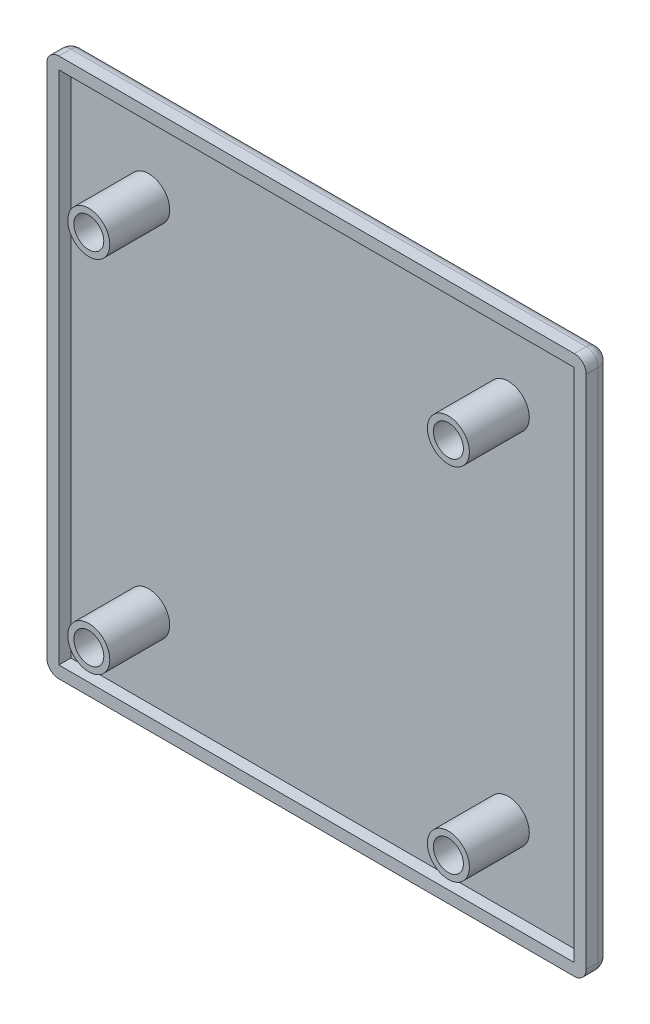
ISO-10303-21;
HEADER;
FILE_DESCRIPTION(('STEP AP214'),'2;1');
FILE_NAME('part.step','',(''),(''),'','','');
FILE_SCHEMA(('AUTOMOTIVE_DESIGN { 1 0 10303 214 1 1 1 1 }'));
ENDSEC;
DATA;
#1=APPLICATION_CONTEXT('core data for automotive mechanical design processes');
#2=APPLICATION_PROTOCOL_DEFINITION('international standard','automotive_design',2000,#1);
#3=PRODUCT_CONTEXT('',#1,'mechanical');
#4=PRODUCT('Part','Part','',(#3));
#5=PRODUCT_RELATED_PRODUCT_CATEGORY('part','',(#4));
#6=PRODUCT_DEFINITION_FORMATION('','',#4);
#7=PRODUCT_DEFINITION_CONTEXT('part definition',#1,'design');
#8=PRODUCT_DEFINITION('design','',#6,#7);
#9=PRODUCT_DEFINITION_SHAPE('','',#8);
#10=(LENGTH_UNIT() NAMED_UNIT(*) SI_UNIT(.MILLI.,.METRE.));
#11=(NAMED_UNIT(*) PLANE_ANGLE_UNIT() SI_UNIT($,.RADIAN.));
#12=(NAMED_UNIT(*) SI_UNIT($,.STERADIAN.) SOLID_ANGLE_UNIT());
#13=UNCERTAINTY_MEASURE_WITH_UNIT(LENGTH_MEASURE(1.E-05),#10,'distance_accuracy_value','');
#14=(GEOMETRIC_REPRESENTATION_CONTEXT(3) GLOBAL_UNCERTAINTY_ASSIGNED_CONTEXT((#13)) GLOBAL_UNIT_ASSIGNED_CONTEXT((#10,
#11,#12)) REPRESENTATION_CONTEXT('',''));
#15=CARTESIAN_POINT('',(0.,0.,0.));
#16=DIRECTION('',(0.,0.,1.));
#17=DIRECTION('',(1.,0.,0.));
#18=AXIS2_PLACEMENT_3D('',#15,#16,#17);
#19=CARTESIAN_POINT('',(0.,0.,0.));
#20=DIRECTION('',(0.,0.,1.));
#21=DIRECTION('',(1.,0.,0.));
#22=AXIS2_PLACEMENT_3D('',#19,#20,#21);
#23=PLANE('',#22);
#24=DIRECTION('',(0.,-1.,0.));
#25=VECTOR('',#24,1.);
#26=CARTESIAN_POINT('',(-43.,45.,0.));
#27=LINE('',#26,#25);
#28=CARTESIAN_POINT('',(-43.,43.,0.));
#29=VERTEX_POINT('',#28);
#30=CARTESIAN_POINT('',(-43.,-43.,0.));
#31=VERTEX_POINT('',#30);
#32=EDGE_CURVE('E140',#29,#31,#27,.T.);
#33=ORIENTED_EDGE('',*,*,#32,.T.);
#34=DIRECTION('',(1.,0.,0.));
#35=VECTOR('',#34,1.);
#36=CARTESIAN_POINT('',(-45.,-43.,0.));
#37=LINE('',#36,#35);
#38=CARTESIAN_POINT('',(43.,-43.,0.));
#39=VERTEX_POINT('',#38);
#40=EDGE_CURVE('E133',#31,#39,#37,.T.);
#41=ORIENTED_EDGE('',*,*,#40,.T.);
#42=DIRECTION('',(0.,1.,0.));
#43=VECTOR('',#42,1.);
#44=CARTESIAN_POINT('',(43.,45.,0.));
#45=LINE('',#44,#43);
#46=CARTESIAN_POINT('',(43.,43.,0.));
#47=VERTEX_POINT('',#46);
#48=EDGE_CURVE('E137',#39,#47,#45,.T.);
#49=ORIENTED_EDGE('',*,*,#48,.T.);
#50=DIRECTION('',(-1.,0.,0.));
#51=VECTOR('',#50,1.);
#52=CARTESIAN_POINT('',(-45.,43.,0.));
#53=LINE('',#52,#51);
#54=EDGE_CURVE('E158',#47,#29,#53,.T.);
#55=ORIENTED_EDGE('',*,*,#54,.T.);
#56=EDGE_LOOP('',(#33,#41,#49,#55));
#57=FACE_BOUND('',#56,.T.);
#58=CARTESIAN_POINT('',(-30.,30.,0.));
#59=DIRECTION('',(0.,0.,1.));
#60=DIRECTION('',(1.,0.,0.));
#61=AXIS2_PLACEMENT_3D('',#58,#59,#60);
#62=CIRCLE('',#61,3.5);
#63=CARTESIAN_POINT('',(-26.5,30.,0.));
#64=VERTEX_POINT('',#63);
#65=EDGE_CURVE('E355',#64,#64,#62,.T.);
#66=ORIENTED_EDGE('',*,*,#65,.F.);
#67=EDGE_LOOP('',(#66));
#68=FACE_BOUND('',#67,.T.);
#69=CARTESIAN_POINT('',(30.,30.,0.));
#70=DIRECTION('',(0.,0.,1.));
#71=DIRECTION('',(1.,0.,0.));
#72=AXIS2_PLACEMENT_3D('',#69,#70,#71);
#73=CIRCLE('',#72,3.5);
#74=CARTESIAN_POINT('',(33.5,30.,0.));
#75=VERTEX_POINT('',#74);
#76=EDGE_CURVE('E363',#75,#75,#73,.T.);
#77=ORIENTED_EDGE('',*,*,#76,.F.);
#78=EDGE_LOOP('',(#77));
#79=FACE_BOUND('',#78,.T.);
#80=CARTESIAN_POINT('',(30.,-30.,0.));
#81=DIRECTION('',(0.,0.,1.));
#82=DIRECTION('',(1.,0.,0.));
#83=AXIS2_PLACEMENT_3D('',#80,#81,#82);
#84=CIRCLE('',#83,3.5);
#85=CARTESIAN_POINT('',(33.5,-30.,0.));
#86=VERTEX_POINT('',#85);
#87=EDGE_CURVE('E372',#86,#86,#84,.T.);
#88=ORIENTED_EDGE('',*,*,#87,.F.);
#89=EDGE_LOOP('',(#88));
#90=FACE_BOUND('',#89,.T.);
#91=CARTESIAN_POINT('',(-30.,-30.,0.));
#92=DIRECTION('',(0.,0.,1.));
#93=DIRECTION('',(1.,0.,0.));
#94=AXIS2_PLACEMENT_3D('',#91,#92,#93);
#95=CIRCLE('',#94,3.5);
#96=CARTESIAN_POINT('',(-26.5,-30.,0.));
#97=VERTEX_POINT('',#96);
#98=EDGE_CURVE('E381',#97,#97,#95,.T.);
#99=ORIENTED_EDGE('',*,*,#98,.F.);
#100=EDGE_LOOP('',(#99));
#101=FACE_BOUND('',#100,.T.);
#102=ADVANCED_FACE('F33',(#57,#68,#79,#90,#101),#23,.T.);
#103=CARTESIAN_POINT('',(-45.,45.,2.));
#104=DIRECTION('',(1.,0.,0.));
#105=DIRECTION('',(0.,1.,0.));
#106=AXIS2_PLACEMENT_3D('',#103,#104,#105);
#107=PLANE('',#106);
#108=DIRECTION('',(0.,-1.,0.));
#109=VECTOR('',#108,1.);
#110=CARTESIAN_POINT('',(-45.,45.,2.));
#111=LINE('',#110,#109);
#112=CARTESIAN_POINT('',(-45.,43.,2.));
#113=VERTEX_POINT('',#112);
#114=CARTESIAN_POINT('',(-45.,-43.,2.));
#115=VERTEX_POINT('',#114);
#116=EDGE_CURVE('E171',#113,#115,#111,.T.);
#117=ORIENTED_EDGE('',*,*,#116,.F.);
#118=DIRECTION('',(0.,0.,-1.));
#119=VECTOR('',#118,1.);
#120=CARTESIAN_POINT('',(-45.,43.,2.));
#121=LINE('',#120,#119);
#122=CARTESIAN_POINT('',(-45.,43.,0.));
#123=VERTEX_POINT('',#122);
#124=EDGE_CURVE('E187',#113,#123,#121,.T.);
#125=ORIENTED_EDGE('',*,*,#124,.T.);
#126=DIRECTION('',(0.,-1.,0.));
#127=VECTOR('',#126,1.);
#128=CARTESIAN_POINT('',(-45.,45.,0.));
#129=LINE('',#128,#127);
#130=CARTESIAN_POINT('',(-45.,-43.,0.));
#131=VERTEX_POINT('',#130);
#132=EDGE_CURVE('E183',#123,#131,#129,.T.);
#133=ORIENTED_EDGE('',*,*,#132,.T.);
#134=DIRECTION('',(0.,0.,-1.));
#135=VECTOR('',#134,1.);
#136=CARTESIAN_POINT('',(-45.,-43.,2.));
#137=LINE('',#136,#135);
#138=EDGE_CURVE('E185',#131,#115,#137,.F.);
#139=ORIENTED_EDGE('',*,*,#138,.T.);
#140=EDGE_LOOP('',(#117,#125,#133,#139));
#141=FACE_BOUND('',#140,.T.);
#142=ADVANCED_FACE('F295',(#141),#107,.F.);
#143=CARTESIAN_POINT('',(-45.,-45.,2.));
#144=DIRECTION('',(0.,1.,0.));
#145=DIRECTION('',(-1.,0.,0.));
#146=AXIS2_PLACEMENT_3D('',#143,#144,#145);
#147=PLANE('',#146);
#148=DIRECTION('',(1.,0.,0.));
#149=VECTOR('',#148,1.);
#150=CARTESIAN_POINT('',(-45.,-45.,2.));
#151=LINE('',#150,#149);
#152=CARTESIAN_POINT('',(-43.,-45.,2.));
#153=VERTEX_POINT('',#152);
#154=CARTESIAN_POINT('',(43.,-45.,2.));
#155=VERTEX_POINT('',#154);
#156=EDGE_CURVE('E174',#153,#155,#151,.T.);
#157=ORIENTED_EDGE('',*,*,#156,.F.);
#158=DIRECTION('',(0.,0.,-1.));
#159=VECTOR('',#158,1.);
#160=CARTESIAN_POINT('',(-43.,-45.,2.));
#161=LINE('',#160,#159);
#162=CARTESIAN_POINT('',(-43.,-45.,0.));
#163=VERTEX_POINT('',#162);
#164=EDGE_CURVE('E208',#153,#163,#161,.T.);
#165=ORIENTED_EDGE('',*,*,#164,.T.);
#166=DIRECTION('',(1.,0.,0.));
#167=VECTOR('',#166,1.);
#168=CARTESIAN_POINT('',(-45.,-45.,0.));
#169=LINE('',#168,#167);
#170=CARTESIAN_POINT('',(43.,-45.,0.));
#171=VERTEX_POINT('',#170);
#172=EDGE_CURVE('E206',#163,#171,#169,.T.);
#173=ORIENTED_EDGE('',*,*,#172,.T.);
#174=DIRECTION('',(0.,0.,-1.));
#175=VECTOR('',#174,1.);
#176=CARTESIAN_POINT('',(43.,-45.,2.));
#177=LINE('',#176,#175);
#178=EDGE_CURVE('E204',#171,#155,#177,.F.);
#179=ORIENTED_EDGE('',*,*,#178,.T.);
#180=EDGE_LOOP('',(#157,#165,#173,#179));
#181=FACE_BOUND('',#180,.T.);
#182=ADVANCED_FACE('F299',(#181),#147,.F.);
#183=CARTESIAN_POINT('',(45.,45.,2.));
#184=DIRECTION('',(-1.,0.,0.));
#185=DIRECTION('',(0.,-1.,0.));
#186=AXIS2_PLACEMENT_3D('',#183,#184,#185);
#187=PLANE('',#186);
#188=DIRECTION('',(0.,1.,0.));
#189=VECTOR('',#188,1.);
#190=CARTESIAN_POINT('',(45.,45.,2.));
#191=LINE('',#190,#189);
#192=CARTESIAN_POINT('',(45.,-43.,2.));
#193=VERTEX_POINT('',#192);
#194=CARTESIAN_POINT('',(45.,43.,2.));
#195=VERTEX_POINT('',#194);
#196=EDGE_CURVE('E177',#193,#195,#191,.T.);
#197=ORIENTED_EDGE('',*,*,#196,.F.);
#198=DIRECTION('',(0.,0.,-1.));
#199=VECTOR('',#198,1.);
#200=CARTESIAN_POINT('',(45.,-43.,2.));
#201=LINE('',#200,#199);
#202=CARTESIAN_POINT('',(45.,-43.,0.));
#203=VERTEX_POINT('',#202);
#204=EDGE_CURVE('E48',#193,#203,#201,.T.);
#205=ORIENTED_EDGE('',*,*,#204,.T.);
#206=DIRECTION('',(0.,1.,0.));
#207=VECTOR('',#206,1.);
#208=CARTESIAN_POINT('',(45.,45.,0.));
#209=LINE('',#208,#207);
#210=CARTESIAN_POINT('',(45.,43.,0.));
#211=VERTEX_POINT('',#210);
#212=EDGE_CURVE('E53',#203,#211,#209,.T.);
#213=ORIENTED_EDGE('',*,*,#212,.T.);
#214=DIRECTION('',(0.,0.,-1.));
#215=VECTOR('',#214,1.);
#216=CARTESIAN_POINT('',(45.,43.,2.));
#217=LINE('',#216,#215);
#218=EDGE_CURVE('E219',#211,#195,#217,.F.);
#219=ORIENTED_EDGE('',*,*,#218,.T.);
#220=EDGE_LOOP('',(#197,#205,#213,#219));
#221=FACE_BOUND('',#220,.T.);
#222=ADVANCED_FACE('F602',(#221),#187,.F.);
#223=CARTESIAN_POINT('',(-45.,45.,2.));
#224=DIRECTION('',(0.,-1.,0.));
#225=DIRECTION('',(0.,0.,-1.));
#226=AXIS2_PLACEMENT_3D('',#223,#224,#225);
#227=PLANE('',#226);
#228=DIRECTION('',(-1.,0.,0.));
#229=VECTOR('',#228,1.);
#230=CARTESIAN_POINT('',(-45.,45.,0.));
#231=LINE('',#230,#229);
#232=CARTESIAN_POINT('',(43.,45.,0.));
#233=VERTEX_POINT('',#232);
#234=CARTESIAN_POINT('',(-43.,45.,0.));
#235=VERTEX_POINT('',#234);
#236=EDGE_CURVE('E192',#233,#235,#231,.T.);
#237=ORIENTED_EDGE('',*,*,#236,.T.);
#238=DIRECTION('',(0.,0.,-1.));
#239=VECTOR('',#238,1.);
#240=CARTESIAN_POINT('',(-43.,45.,2.));
#241=LINE('',#240,#239);
#242=CARTESIAN_POINT('',(-43.,45.,2.));
#243=VERTEX_POINT('',#242);
#244=EDGE_CURVE('E194',#235,#243,#241,.F.);
#245=ORIENTED_EDGE('',*,*,#244,.T.);
#246=DIRECTION('',(-1.,0.,0.));
#247=VECTOR('',#246,1.);
#248=CARTESIAN_POINT('',(-45.,45.,2.));
#249=LINE('',#248,#247);
#250=CARTESIAN_POINT('',(43.,45.,2.));
#251=VERTEX_POINT('',#250);
#252=EDGE_CURVE('E180',#251,#243,#249,.T.);
#253=ORIENTED_EDGE('',*,*,#252,.F.);
#254=DIRECTION('',(0.,0.,-1.));
#255=VECTOR('',#254,1.);
#256=CARTESIAN_POINT('',(43.,45.,2.));
#257=LINE('',#256,#255);
#258=EDGE_CURVE('E190',#251,#233,#257,.T.);
#259=ORIENTED_EDGE('',*,*,#258,.T.);
#260=EDGE_LOOP('',(#237,#245,#253,#259));
#261=FACE_BOUND('',#260,.T.);
#262=ADVANCED_FACE('F593',(#261),#227,.F.);
#263=CARTESIAN_POINT('',(0.,0.,2.));
#264=DIRECTION('',(0.,0.,1.));
#265=DIRECTION('',(1.,0.,0.));
#266=AXIS2_PLACEMENT_3D('',#263,#264,#265);
#267=PLANE('',#266);
#268=DIRECTION('',(0.,-1.,0.));
#269=VECTOR('',#268,1.);
#270=CARTESIAN_POINT('',(-43.,45.,2.));
#271=LINE('',#270,#269);
#272=CARTESIAN_POINT('',(-43.,43.,2.));
#273=VERTEX_POINT('',#272);
#274=CARTESIAN_POINT('',(-43.,-43.,2.));
#275=VERTEX_POINT('',#274);
#276=EDGE_CURVE('E160',#273,#275,#271,.T.);
#277=ORIENTED_EDGE('',*,*,#276,.F.);
#278=DIRECTION('',(-1.,0.,0.));
#279=VECTOR('',#278,1.);
#280=CARTESIAN_POINT('',(-45.,43.,2.));
#281=LINE('',#280,#279);
#282=CARTESIAN_POINT('',(43.,43.,2.));
#283=VERTEX_POINT('',#282);
#284=EDGE_CURVE('E169',#283,#273,#281,.T.);
#285=ORIENTED_EDGE('',*,*,#284,.F.);
#286=DIRECTION('',(0.,1.,0.));
#287=VECTOR('',#286,1.);
#288=CARTESIAN_POINT('',(43.,45.,2.));
#289=LINE('',#288,#287);
#290=CARTESIAN_POINT('',(43.,-43.,2.));
#291=VERTEX_POINT('',#290);
#292=EDGE_CURVE('E167',#291,#283,#289,.T.);
#293=ORIENTED_EDGE('',*,*,#292,.F.);
#294=DIRECTION('',(1.,0.,0.));
#295=VECTOR('',#294,1.);
#296=CARTESIAN_POINT('',(-45.,-43.,2.));
#297=LINE('',#296,#295);
#298=EDGE_CURVE('E149',#275,#291,#297,.T.);
#299=ORIENTED_EDGE('',*,*,#298,.F.);
#300=EDGE_LOOP('',(#277,#285,#293,#299));
#301=FACE_BOUND('',#300,.T.);
#302=ORIENTED_EDGE('',*,*,#252,.T.);
#303=CARTESIAN_POINT('',(-43.,43.,2.));
#304=DIRECTION('',(0.,0.,1.));
#305=DIRECTION('',(1.,0.,0.));
#306=AXIS2_PLACEMENT_3D('',#303,#304,#305);
#307=CIRCLE('',#306,2.);
#308=EDGE_CURVE('E202',#243,#113,#307,.T.);
#309=ORIENTED_EDGE('',*,*,#308,.T.);
#310=ORIENTED_EDGE('',*,*,#116,.T.);
#311=CARTESIAN_POINT('',(-43.,-43.,2.));
#312=DIRECTION('',(0.,0.,1.));
#313=DIRECTION('',(1.,0.,0.));
#314=AXIS2_PLACEMENT_3D('',#311,#312,#313);
#315=CIRCLE('',#314,2.);
#316=EDGE_CURVE('E200',#115,#153,#315,.T.);
#317=ORIENTED_EDGE('',*,*,#316,.T.);
#318=ORIENTED_EDGE('',*,*,#156,.T.);
#319=CARTESIAN_POINT('',(43.,-43.,2.));
#320=DIRECTION('',(0.,0.,1.));
#321=DIRECTION('',(1.,0.,0.));
#322=AXIS2_PLACEMENT_3D('',#319,#320,#321);
#323=CIRCLE('',#322,2.);
#324=EDGE_CURVE('E198',#155,#193,#323,.T.);
#325=ORIENTED_EDGE('',*,*,#324,.T.);
#326=ORIENTED_EDGE('',*,*,#196,.T.);
#327=CARTESIAN_POINT('',(43.,43.,2.));
#328=DIRECTION('',(0.,0.,1.));
#329=DIRECTION('',(1.,0.,0.));
#330=AXIS2_PLACEMENT_3D('',#327,#328,#329);
#331=CIRCLE('',#330,2.);
#332=EDGE_CURVE('E196',#195,#251,#331,.T.);
#333=ORIENTED_EDGE('',*,*,#332,.T.);
#334=EDGE_LOOP('',(#302,#309,#310,#317,#318,#325,#326,#333));
#335=FACE_BOUND('',#334,.T.);
#336=ADVANCED_FACE('F582',(#301,#335),#267,.T.);
#337=CARTESIAN_POINT('',(0.,0.,-2.));
#338=DIRECTION('',(0.,0.,1.));
#339=DIRECTION('',(1.,0.,0.));
#340=AXIS2_PLACEMENT_3D('',#337,#338,#339);
#341=PLANE('',#340);
#342=DIRECTION('',(1.,0.,0.));
#343=VECTOR('',#342,1.);
#344=CARTESIAN_POINT('',(0.,-43.,-2.));
#345=LINE('',#344,#343);
#346=CARTESIAN_POINT('',(43.,-43.,-2.));
#347=VERTEX_POINT('',#346);
#348=CARTESIAN_POINT('',(-43.,-43.,-2.));
#349=VERTEX_POINT('',#348);
#350=EDGE_CURVE('E214',#347,#349,#345,.F.);
#351=ORIENTED_EDGE('',*,*,#350,.T.);
#352=DIRECTION('',(0.,-1.,0.));
#353=VECTOR('',#352,1.);
#354=CARTESIAN_POINT('',(-43.,0.,-2.));
#355=LINE('',#354,#353);
#356=CARTESIAN_POINT('',(-43.,43.,-2.));
#357=VERTEX_POINT('',#356);
#358=EDGE_CURVE('E216',#349,#357,#355,.F.);
#359=ORIENTED_EDGE('',*,*,#358,.T.);
#360=DIRECTION('',(-1.,0.,0.));
#361=VECTOR('',#360,1.);
#362=CARTESIAN_POINT('',(0.,43.,-2.));
#363=LINE('',#362,#361);
#364=CARTESIAN_POINT('',(43.,43.,-2.));
#365=VERTEX_POINT('',#364);
#366=EDGE_CURVE('E210',#357,#365,#363,.F.);
#367=ORIENTED_EDGE('',*,*,#366,.T.);
#368=DIRECTION('',(0.,1.,0.));
#369=VECTOR('',#368,1.);
#370=CARTESIAN_POINT('',(43.,0.,-2.));
#371=LINE('',#370,#369);
#372=EDGE_CURVE('E212',#365,#347,#371,.F.);
#373=ORIENTED_EDGE('',*,*,#372,.T.);
#374=EDGE_LOOP('',(#351,#359,#367,#373));
#375=FACE_BOUND('',#374,.T.);
#376=ADVANCED_FACE('F334',(#375),#341,.F.);
#377=CARTESIAN_POINT('',(-43.,45.,2.));
#378=DIRECTION('',(1.,0.,0.));
#379=DIRECTION('',(0.,1.,0.));
#380=AXIS2_PLACEMENT_3D('',#377,#378,#379);
#381=PLANE('',#380);
#382=ORIENTED_EDGE('',*,*,#32,.F.);
#383=DIRECTION('',(0.,0.,-1.));
#384=VECTOR('',#383,1.);
#385=CARTESIAN_POINT('',(-43.,43.,2.));
#386=LINE('',#385,#384);
#387=EDGE_CURVE('E163',#273,#29,#386,.T.);
#388=ORIENTED_EDGE('',*,*,#387,.F.);
#389=ORIENTED_EDGE('',*,*,#276,.T.);
#390=DIRECTION('',(0.,0.,-1.));
#391=VECTOR('',#390,1.);
#392=CARTESIAN_POINT('',(-43.,-43.,2.));
#393=LINE('',#392,#391);
#394=EDGE_CURVE('E153',#275,#31,#393,.T.);
#395=ORIENTED_EDGE('',*,*,#394,.T.);
#396=EDGE_LOOP('',(#382,#388,#389,#395));
#397=FACE_BOUND('',#396,.T.);
#398=ADVANCED_FACE('F331',(#397),#381,.T.);
#399=CARTESIAN_POINT('',(-45.,-43.,2.));
#400=DIRECTION('',(0.,1.,0.));
#401=DIRECTION('',(-1.,0.,0.));
#402=AXIS2_PLACEMENT_3D('',#399,#400,#401);
#403=PLANE('',#402);
#404=ORIENTED_EDGE('',*,*,#40,.F.);
#405=ORIENTED_EDGE('',*,*,#394,.F.);
#406=ORIENTED_EDGE('',*,*,#298,.T.);
#407=DIRECTION('',(0.,0.,-1.));
#408=VECTOR('',#407,1.);
#409=CARTESIAN_POINT('',(43.,-43.,2.));
#410=LINE('',#409,#408);
#411=EDGE_CURVE('E146',#291,#39,#410,.T.);
#412=ORIENTED_EDGE('',*,*,#411,.T.);
#413=EDGE_LOOP('',(#404,#405,#406,#412));
#414=FACE_BOUND('',#413,.T.);
#415=ADVANCED_FACE('F147',(#414),#403,.T.);
#416=CARTESIAN_POINT('',(43.,45.,2.));
#417=DIRECTION('',(-1.,0.,0.));
#418=DIRECTION('',(0.,-1.,0.));
#419=AXIS2_PLACEMENT_3D('',#416,#417,#418);
#420=PLANE('',#419);
#421=ORIENTED_EDGE('',*,*,#48,.F.);
#422=ORIENTED_EDGE('',*,*,#411,.F.);
#423=ORIENTED_EDGE('',*,*,#292,.T.);
#424=DIRECTION('',(0.,0.,-1.));
#425=VECTOR('',#424,1.);
#426=CARTESIAN_POINT('',(43.,43.,2.));
#427=LINE('',#426,#425);
#428=EDGE_CURVE('E154',#283,#47,#427,.T.);
#429=ORIENTED_EDGE('',*,*,#428,.T.);
#430=EDGE_LOOP('',(#421,#422,#423,#429));
#431=FACE_BOUND('',#430,.T.);
#432=ADVANCED_FACE('F156',(#431),#420,.T.);
#433=CARTESIAN_POINT('',(-45.,43.,2.));
#434=DIRECTION('',(0.,-1.,0.));
#435=DIRECTION('',(0.,0.,-1.));
#436=AXIS2_PLACEMENT_3D('',#433,#434,#435);
#437=PLANE('',#436);
#438=ORIENTED_EDGE('',*,*,#54,.F.);
#439=ORIENTED_EDGE('',*,*,#428,.F.);
#440=ORIENTED_EDGE('',*,*,#284,.T.);
#441=ORIENTED_EDGE('',*,*,#387,.T.);
#442=EDGE_LOOP('',(#438,#439,#440,#441));
#443=FACE_BOUND('',#442,.T.);
#444=ADVANCED_FACE('F339',(#443),#437,.T.);
#445=CARTESIAN_POINT('',(43.,-43.,2.));
#446=DIRECTION('',(0.,0.,-1.));
#447=DIRECTION('',(-1.,0.,0.));
#448=AXIS2_PLACEMENT_3D('',#445,#446,#447);
#449=CYLINDRICAL_SURFACE('',#448,2.);
#450=CARTESIAN_POINT('',(43.,-43.,0.));
#451=DIRECTION('',(0.,0.,-1.));
#452=DIRECTION('',(-1.,0.,0.));
#453=AXIS2_PLACEMENT_3D('',#450,#451,#452);
#454=CIRCLE('',#453,2.);
#455=EDGE_CURVE('E256',#203,#171,#454,.T.);
#456=ORIENTED_EDGE('',*,*,#455,.F.);
#457=ORIENTED_EDGE('',*,*,#204,.F.);
#458=ORIENTED_EDGE('',*,*,#324,.F.);
#459=ORIENTED_EDGE('',*,*,#178,.F.);
#460=EDGE_LOOP('',(#456,#457,#458,#459));
#461=FACE_BOUND('',#460,.T.);
#462=ADVANCED_FACE('F35',(#461),#449,.T.);
#463=CARTESIAN_POINT('',(43.,-43.,0.));
#464=DIRECTION('',(0.,0.,1.));
#465=DIRECTION('',(1.,0.,0.));
#466=AXIS2_PLACEMENT_3D('',#463,#464,#465);
#467=SPHERICAL_SURFACE('',#466,2.);
#468=CARTESIAN_POINT('',(43.,-43.,0.));
#469=DIRECTION('',(0.,-1.,0.));
#470=DIRECTION('',(1.,0.,0.));
#471=AXIS2_PLACEMENT_3D('',#468,#469,#470);
#472=CIRCLE('',#471,2.);
#473=EDGE_CURVE('E250',#203,#347,#472,.F.);
#474=ORIENTED_EDGE('',*,*,#473,.F.);
#475=ORIENTED_EDGE('',*,*,#455,.T.);
#476=CARTESIAN_POINT('',(43.,-43.,0.));
#477=DIRECTION('',(1.,0.,0.));
#478=DIRECTION('',(0.,0.,-1.));
#479=AXIS2_PLACEMENT_3D('',#476,#477,#478);
#480=CIRCLE('',#479,2.);
#481=EDGE_CURVE('E253',#347,#171,#480,.F.);
#482=ORIENTED_EDGE('',*,*,#481,.F.);
#483=EDGE_LOOP('',(#474,#475,#482));
#484=FACE_BOUND('',#483,.T.);
#485=ADVANCED_FACE('F345',(#484),#467,.T.);
#486=CARTESIAN_POINT('',(-43.,-43.,2.));
#487=DIRECTION('',(0.,0.,-1.));
#488=DIRECTION('',(-1.,0.,0.));
#489=AXIS2_PLACEMENT_3D('',#486,#487,#488);
#490=CYLINDRICAL_SURFACE('',#489,2.);
#491=ORIENTED_EDGE('',*,*,#316,.F.);
#492=ORIENTED_EDGE('',*,*,#138,.F.);
#493=CARTESIAN_POINT('',(-43.,-43.,0.));
#494=DIRECTION('',(0.,0.,-1.));
#495=DIRECTION('',(-1.,0.,0.));
#496=AXIS2_PLACEMENT_3D('',#493,#494,#495);
#497=CIRCLE('',#496,2.);
#498=EDGE_CURVE('E247',#163,#131,#497,.T.);
#499=ORIENTED_EDGE('',*,*,#498,.F.);
#500=ORIENTED_EDGE('',*,*,#164,.F.);
#501=EDGE_LOOP('',(#491,#492,#499,#500));
#502=FACE_BOUND('',#501,.T.);
#503=ADVANCED_FACE('F550',(#502),#490,.T.);
#504=CARTESIAN_POINT('',(-45.,-43.,0.));
#505=DIRECTION('',(1.,0.,0.));
#506=DIRECTION('',(0.,1.,0.));
#507=AXIS2_PLACEMENT_3D('',#504,#505,#506);
#508=CYLINDRICAL_SURFACE('',#507,2.);
#509=ORIENTED_EDGE('',*,*,#481,.T.);
#510=ORIENTED_EDGE('',*,*,#172,.F.);
#511=CARTESIAN_POINT('',(-43.,-43.,0.));
#512=DIRECTION('',(-1.,0.,0.));
#513=DIRECTION('',(0.,0.,1.));
#514=AXIS2_PLACEMENT_3D('',#511,#512,#513);
#515=CIRCLE('',#514,2.);
#516=EDGE_CURVE('E244',#349,#163,#515,.T.);
#517=ORIENTED_EDGE('',*,*,#516,.F.);
#518=ORIENTED_EDGE('',*,*,#350,.F.);
#519=EDGE_LOOP('',(#509,#510,#517,#518));
#520=FACE_BOUND('',#519,.T.);
#521=ADVANCED_FACE('F540',(#520),#508,.T.);
#522=CARTESIAN_POINT('',(43.,45.,0.));
#523=DIRECTION('',(0.,1.,0.));
#524=DIRECTION('',(-1.,0.,0.));
#525=AXIS2_PLACEMENT_3D('',#522,#523,#524);
#526=CYLINDRICAL_SURFACE('',#525,2.);
#527=ORIENTED_EDGE('',*,*,#473,.T.);
#528=ORIENTED_EDGE('',*,*,#372,.F.);
#529=CARTESIAN_POINT('',(43.,43.,0.));
#530=DIRECTION('',(0.,1.,0.));
#531=DIRECTION('',(0.,0.,1.));
#532=AXIS2_PLACEMENT_3D('',#529,#530,#531);
#533=CIRCLE('',#532,2.);
#534=EDGE_CURVE('E241',#211,#365,#533,.T.);
#535=ORIENTED_EDGE('',*,*,#534,.F.);
#536=ORIENTED_EDGE('',*,*,#212,.F.);
#537=EDGE_LOOP('',(#527,#528,#535,#536));
#538=FACE_BOUND('',#537,.T.);
#539=ADVANCED_FACE('F530',(#538),#526,.T.);
#540=CARTESIAN_POINT('',(43.,43.,2.));
#541=DIRECTION('',(0.,0.,-1.));
#542=DIRECTION('',(-1.,0.,0.));
#543=AXIS2_PLACEMENT_3D('',#540,#541,#542);
#544=CYLINDRICAL_SURFACE('',#543,2.);
#545=ORIENTED_EDGE('',*,*,#332,.F.);
#546=ORIENTED_EDGE('',*,*,#218,.F.);
#547=CARTESIAN_POINT('',(43.,43.,0.));
#548=DIRECTION('',(0.,0.,-1.));
#549=DIRECTION('',(-1.,0.,0.));
#550=AXIS2_PLACEMENT_3D('',#547,#548,#549);
#551=CIRCLE('',#550,2.);
#552=EDGE_CURVE('E238',#233,#211,#551,.T.);
#553=ORIENTED_EDGE('',*,*,#552,.F.);
#554=ORIENTED_EDGE('',*,*,#258,.F.);
#555=EDGE_LOOP('',(#545,#546,#553,#554));
#556=FACE_BOUND('',#555,.T.);
#557=ADVANCED_FACE('F520',(#556),#544,.T.);
#558=CARTESIAN_POINT('',(-43.,-43.,0.));
#559=DIRECTION('',(0.,0.,1.));
#560=DIRECTION('',(1.,0.,0.));
#561=AXIS2_PLACEMENT_3D('',#558,#559,#560);
#562=SPHERICAL_SURFACE('',#561,2.);
#563=ORIENTED_EDGE('',*,*,#516,.T.);
#564=ORIENTED_EDGE('',*,*,#498,.T.);
#565=CARTESIAN_POINT('',(-43.,-43.,0.));
#566=DIRECTION('',(0.,-1.,0.));
#567=DIRECTION('',(0.,0.,-1.));
#568=AXIS2_PLACEMENT_3D('',#565,#566,#567);
#569=CIRCLE('',#568,2.);
#570=EDGE_CURVE('E235',#349,#131,#569,.F.);
#571=ORIENTED_EDGE('',*,*,#570,.F.);
#572=EDGE_LOOP('',(#563,#564,#571));
#573=FACE_BOUND('',#572,.T.);
#574=ADVANCED_FACE('F510',(#573),#562,.T.);
#575=CARTESIAN_POINT('',(43.,43.,0.));
#576=DIRECTION('',(0.,0.,1.));
#577=DIRECTION('',(1.,0.,0.));
#578=AXIS2_PLACEMENT_3D('',#575,#576,#577);
#579=SPHERICAL_SURFACE('',#578,2.);
#580=ORIENTED_EDGE('',*,*,#552,.T.);
#581=ORIENTED_EDGE('',*,*,#534,.T.);
#582=CARTESIAN_POINT('',(43.,43.,0.));
#583=DIRECTION('',(1.,0.,0.));
#584=DIRECTION('',(0.,0.,-1.));
#585=AXIS2_PLACEMENT_3D('',#582,#583,#584);
#586=CIRCLE('',#585,2.);
#587=EDGE_CURVE('E232',#233,#365,#586,.F.);
#588=ORIENTED_EDGE('',*,*,#587,.F.);
#589=EDGE_LOOP('',(#580,#581,#588));
#590=FACE_BOUND('',#589,.T.);
#591=ADVANCED_FACE('F500',(#590),#579,.T.);
#592=CARTESIAN_POINT('',(-43.,45.,0.));
#593=DIRECTION('',(0.,-1.,0.));
#594=DIRECTION('',(1.,0.,0.));
#595=AXIS2_PLACEMENT_3D('',#592,#593,#594);
#596=CYLINDRICAL_SURFACE('',#595,2.);
#597=ORIENTED_EDGE('',*,*,#570,.T.);
#598=ORIENTED_EDGE('',*,*,#132,.F.);
#599=CARTESIAN_POINT('',(-43.,43.,0.));
#600=DIRECTION('',(0.,1.,0.));
#601=DIRECTION('',(0.,0.,1.));
#602=AXIS2_PLACEMENT_3D('',#599,#600,#601);
#603=CIRCLE('',#602,2.);
#604=EDGE_CURVE('E229',#357,#123,#603,.T.);
#605=ORIENTED_EDGE('',*,*,#604,.F.);
#606=ORIENTED_EDGE('',*,*,#358,.F.);
#607=EDGE_LOOP('',(#597,#598,#605,#606));
#608=FACE_BOUND('',#607,.T.);
#609=ADVANCED_FACE('F490',(#608),#596,.T.);
#610=CARTESIAN_POINT('',(-45.,43.,0.));
#611=DIRECTION('',(-1.,0.,0.));
#612=DIRECTION('',(0.,0.,1.));
#613=AXIS2_PLACEMENT_3D('',#610,#611,#612);
#614=CYLINDRICAL_SURFACE('',#613,2.);
#615=ORIENTED_EDGE('',*,*,#587,.T.);
#616=ORIENTED_EDGE('',*,*,#366,.F.);
#617=CARTESIAN_POINT('',(-43.,43.,0.));
#618=DIRECTION('',(-1.,0.,0.));
#619=DIRECTION('',(0.,0.,1.));
#620=AXIS2_PLACEMENT_3D('',#617,#618,#619);
#621=CIRCLE('',#620,2.);
#622=EDGE_CURVE('E226',#235,#357,#621,.T.);
#623=ORIENTED_EDGE('',*,*,#622,.F.);
#624=ORIENTED_EDGE('',*,*,#236,.F.);
#625=EDGE_LOOP('',(#615,#616,#623,#624));
#626=FACE_BOUND('',#625,.T.);
#627=ADVANCED_FACE('F480',(#626),#614,.T.);
#628=CARTESIAN_POINT('',(-43.,43.,0.));
#629=DIRECTION('',(0.,0.,1.));
#630=DIRECTION('',(1.,0.,0.));
#631=AXIS2_PLACEMENT_3D('',#628,#629,#630);
#632=SPHERICAL_SURFACE('',#631,2.);
#633=ORIENTED_EDGE('',*,*,#622,.T.);
#634=ORIENTED_EDGE('',*,*,#604,.T.);
#635=CARTESIAN_POINT('',(-43.,43.,0.));
#636=DIRECTION('',(0.,0.,-1.));
#637=DIRECTION('',(-1.,0.,0.));
#638=AXIS2_PLACEMENT_3D('',#635,#636,#637);
#639=CIRCLE('',#638,2.);
#640=EDGE_CURVE('E224',#235,#123,#639,.F.);
#641=ORIENTED_EDGE('',*,*,#640,.F.);
#642=EDGE_LOOP('',(#633,#634,#641));
#643=FACE_BOUND('',#642,.T.);
#644=ADVANCED_FACE('F469',(#643),#632,.T.);
#645=CARTESIAN_POINT('',(-43.,43.,2.));
#646=DIRECTION('',(0.,0.,-1.));
#647=DIRECTION('',(-1.,0.,0.));
#648=AXIS2_PLACEMENT_3D('',#645,#646,#647);
#649=CYLINDRICAL_SURFACE('',#648,2.);
#650=ORIENTED_EDGE('',*,*,#308,.F.);
#651=ORIENTED_EDGE('',*,*,#244,.F.);
#652=ORIENTED_EDGE('',*,*,#640,.T.);
#653=ORIENTED_EDGE('',*,*,#124,.F.);
#654=EDGE_LOOP('',(#650,#651,#652,#653));
#655=FACE_BOUND('',#654,.T.);
#656=ADVANCED_FACE('F328',(#655),#649,.T.);
#657=CARTESIAN_POINT('',(-30.,30.,10.));
#658=DIRECTION('',(0.,0.,1.));
#659=DIRECTION('',(1.,0.,0.));
#660=AXIS2_PLACEMENT_3D('',#657,#658,#659);
#661=PLANE('',#660);
#662=CARTESIAN_POINT('',(-30.,30.,10.));
#663=DIRECTION('',(0.,0.,1.));
#664=DIRECTION('',(1.,0.,0.));
#665=AXIS2_PLACEMENT_3D('',#662,#663,#664);
#666=CIRCLE('',#665,3.5);
#667=CARTESIAN_POINT('',(-26.5,30.,10.));
#668=VERTEX_POINT('',#667);
#669=EDGE_CURVE('E227',#668,#668,#666,.T.);
#670=ORIENTED_EDGE('',*,*,#669,.T.);
#671=EDGE_LOOP('',(#670));
#672=FACE_BOUND('',#671,.T.);
#673=CARTESIAN_POINT('',(-30.,30.,10.));
#674=DIRECTION('',(0.,0.,1.));
#675=DIRECTION('',(1.,0.,0.));
#676=AXIS2_PLACEMENT_3D('',#673,#674,#675);
#677=CIRCLE('',#676,2.5);
#678=CARTESIAN_POINT('',(-27.5,30.,10.));
#679=VERTEX_POINT('',#678);
#680=EDGE_CURVE('E358',#679,#679,#677,.T.);
#681=ORIENTED_EDGE('',*,*,#680,.F.);
#682=EDGE_LOOP('',(#681));
#683=FACE_BOUND('',#682,.T.);
#684=ADVANCED_FACE('F321',(#672,#683),#661,.T.);
#685=CARTESIAN_POINT('',(-30.,30.,10.));
#686=DIRECTION('',(0.,0.,-1.));
#687=DIRECTION('',(-1.,0.,0.));
#688=AXIS2_PLACEMENT_3D('',#685,#686,#687);
#689=CYLINDRICAL_SURFACE('',#688,3.5);
#690=ORIENTED_EDGE('',*,*,#669,.F.);
#691=EDGE_LOOP('',(#690));
#692=FACE_BOUND('',#691,.T.);
#693=ORIENTED_EDGE('',*,*,#65,.T.);
#694=EDGE_LOOP('',(#693));
#695=FACE_BOUND('',#694,.T.);
#696=ADVANCED_FACE('F313',(#692,#695),#689,.T.);
#697=CARTESIAN_POINT('',(-30.,30.,10.));
#698=DIRECTION('',(0.,0.,-1.));
#699=DIRECTION('',(-1.,0.,0.));
#700=AXIS2_PLACEMENT_3D('',#697,#698,#699);
#701=CYLINDRICAL_SURFACE('',#700,2.5);
#702=ORIENTED_EDGE('',*,*,#680,.T.);
#703=EDGE_LOOP('',(#702));
#704=FACE_BOUND('',#703,.T.);
#705=CARTESIAN_POINT('',(-30.,30.,0.));
#706=DIRECTION('',(0.,0.,1.));
#707=DIRECTION('',(1.,0.,0.));
#708=AXIS2_PLACEMENT_3D('',#705,#706,#707);
#709=CIRCLE('',#708,2.5);
#710=CARTESIAN_POINT('',(-27.5,30.,0.));
#711=VERTEX_POINT('',#710);
#712=EDGE_CURVE('E223',#711,#711,#709,.F.);
#713=ORIENTED_EDGE('',*,*,#712,.T.);
#714=EDGE_LOOP('',(#713));
#715=FACE_BOUND('',#714,.T.);
#716=ADVANCED_FACE('F304',(#704,#715),#701,.F.);
#717=ORIENTED_EDGE('',*,*,#712,.F.);
#718=EDGE_LOOP('',(#717));
#719=FACE_BOUND('',#718,.T.);
#720=ADVANCED_FACE('F284',(#719),#23,.T.);
#721=CARTESIAN_POINT('',(30.,30.,10.));
#722=DIRECTION('',(0.,0.,1.));
#723=DIRECTION('',(1.,0.,0.));
#724=AXIS2_PLACEMENT_3D('',#721,#722,#723);
#725=PLANE('',#724);
#726=CARTESIAN_POINT('',(30.,30.,10.));
#727=DIRECTION('',(0.,0.,1.));
#728=DIRECTION('',(1.,0.,0.));
#729=AXIS2_PLACEMENT_3D('',#726,#727,#728);
#730=CIRCLE('',#729,3.5);
#731=CARTESIAN_POINT('',(33.5,30.,10.));
#732=VERTEX_POINT('',#731);
#733=EDGE_CURVE('E362',#732,#732,#730,.T.);
#734=ORIENTED_EDGE('',*,*,#733,.T.);
#735=EDGE_LOOP('',(#734));
#736=FACE_BOUND('',#735,.T.);
#737=CARTESIAN_POINT('',(30.,30.,10.));
#738=DIRECTION('',(0.,0.,1.));
#739=DIRECTION('',(1.,0.,0.));
#740=AXIS2_PLACEMENT_3D('',#737,#738,#739);
#741=CIRCLE('',#740,2.49999999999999);
#742=CARTESIAN_POINT('',(32.5,30.,10.));
#743=VERTEX_POINT('',#742);
#744=EDGE_CURVE('E366',#743,#743,#741,.T.);
#745=ORIENTED_EDGE('',*,*,#744,.F.);
#746=EDGE_LOOP('',(#745));
#747=FACE_BOUND('',#746,.T.);
#748=ADVANCED_FACE('F303',(#736,#747),#725,.T.);
#749=CARTESIAN_POINT('',(30.,30.,10.));
#750=DIRECTION('',(0.,0.,-1.));
#751=DIRECTION('',(-1.,0.,0.));
#752=AXIS2_PLACEMENT_3D('',#749,#750,#751);
#753=CYLINDRICAL_SURFACE('',#752,3.5);
#754=ORIENTED_EDGE('',*,*,#733,.F.);
#755=EDGE_LOOP('',(#754));
#756=FACE_BOUND('',#755,.T.);
#757=ORIENTED_EDGE('',*,*,#76,.T.);
#758=EDGE_LOOP('',(#757));
#759=FACE_BOUND('',#758,.T.);
#760=ADVANCED_FACE('F310',(#756,#759),#753,.T.);
#761=CARTESIAN_POINT('',(30.,30.,10.));
#762=DIRECTION('',(0.,0.,-1.));
#763=DIRECTION('',(-1.,0.,0.));
#764=AXIS2_PLACEMENT_3D('',#761,#762,#763);
#765=CYLINDRICAL_SURFACE('',#764,2.49999999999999);
#766=ORIENTED_EDGE('',*,*,#744,.T.);
#767=EDGE_LOOP('',(#766));
#768=FACE_BOUND('',#767,.T.);
#769=CARTESIAN_POINT('',(30.,30.,0.));
#770=DIRECTION('',(0.,0.,1.));
#771=DIRECTION('',(1.,0.,0.));
#772=AXIS2_PLACEMENT_3D('',#769,#770,#771);
#773=CIRCLE('',#772,2.49999999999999);
#774=CARTESIAN_POINT('',(32.5,30.,0.));
#775=VERTEX_POINT('',#774);
#776=EDGE_CURVE('E261',#775,#775,#773,.F.);
#777=ORIENTED_EDGE('',*,*,#776,.T.);
#778=EDGE_LOOP('',(#777));
#779=FACE_BOUND('',#778,.T.);
#780=ADVANCED_FACE('F289',(#768,#779),#765,.F.);
#781=ORIENTED_EDGE('',*,*,#776,.F.);
#782=EDGE_LOOP('',(#781));
#783=FACE_BOUND('',#782,.T.);
#784=ADVANCED_FACE('F272',(#783),#23,.T.);
#785=CARTESIAN_POINT('',(30.,-30.,10.));
#786=DIRECTION('',(0.,0.,1.));
#787=DIRECTION('',(1.,0.,0.));
#788=AXIS2_PLACEMENT_3D('',#785,#786,#787);
#789=PLANE('',#788);
#790=CARTESIAN_POINT('',(30.,-30.,10.));
#791=DIRECTION('',(0.,0.,1.));
#792=DIRECTION('',(1.,0.,0.));
#793=AXIS2_PLACEMENT_3D('',#790,#791,#792);
#794=CIRCLE('',#793,3.5);
#795=CARTESIAN_POINT('',(33.5,-30.,10.));
#796=VERTEX_POINT('',#795);
#797=EDGE_CURVE('E371',#796,#796,#794,.T.);
#798=ORIENTED_EDGE('',*,*,#797,.T.);
#799=EDGE_LOOP('',(#798));
#800=FACE_BOUND('',#799,.T.);
#801=CARTESIAN_POINT('',(30.,-30.,10.));
#802=DIRECTION('',(0.,0.,1.));
#803=DIRECTION('',(1.,0.,0.));
#804=AXIS2_PLACEMENT_3D('',#801,#802,#803);
#805=CIRCLE('',#804,2.49999999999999);
#806=CARTESIAN_POINT('',(32.5,-30.,10.));
#807=VERTEX_POINT('',#806);
#808=EDGE_CURVE('E375',#807,#807,#805,.T.);
#809=ORIENTED_EDGE('',*,*,#808,.F.);
#810=EDGE_LOOP('',(#809));
#811=FACE_BOUND('',#810,.T.);
#812=ADVANCED_FACE('F288',(#800,#811),#789,.T.);
#813=CARTESIAN_POINT('',(30.,-30.,10.));
#814=DIRECTION('',(0.,0.,-1.));
#815=DIRECTION('',(-1.,0.,0.));
#816=AXIS2_PLACEMENT_3D('',#813,#814,#815);
#817=CYLINDRICAL_SURFACE('',#816,3.5);
#818=ORIENTED_EDGE('',*,*,#797,.F.);
#819=EDGE_LOOP('',(#818));
#820=FACE_BOUND('',#819,.T.);
#821=ORIENTED_EDGE('',*,*,#87,.T.);
#822=EDGE_LOOP('',(#821));
#823=FACE_BOUND('',#822,.T.);
#824=ADVANCED_FACE('F281',(#820,#823),#817,.T.);
#825=CARTESIAN_POINT('',(30.,-30.,10.));
#826=DIRECTION('',(0.,0.,-1.));
#827=DIRECTION('',(-1.,0.,0.));
#828=AXIS2_PLACEMENT_3D('',#825,#826,#827);
#829=CYLINDRICAL_SURFACE('',#828,2.49999999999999);
#830=ORIENTED_EDGE('',*,*,#808,.T.);
#831=EDGE_LOOP('',(#830));
#832=FACE_BOUND('',#831,.T.);
#833=CARTESIAN_POINT('',(30.,-30.,0.));
#834=DIRECTION('',(0.,0.,1.));
#835=DIRECTION('',(1.,0.,0.));
#836=AXIS2_PLACEMENT_3D('',#833,#834,#835);
#837=CIRCLE('',#836,2.49999999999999);
#838=CARTESIAN_POINT('',(32.5,-30.,0.));
#839=VERTEX_POINT('',#838);
#840=EDGE_CURVE('E41',#839,#839,#837,.F.);
#841=ORIENTED_EDGE('',*,*,#840,.T.);
#842=EDGE_LOOP('',(#841));
#843=FACE_BOUND('',#842,.T.);
#844=ADVANCED_FACE('F266',(#832,#843),#829,.F.);
#845=ORIENTED_EDGE('',*,*,#840,.F.);
#846=EDGE_LOOP('',(#845));
#847=FACE_BOUND('',#846,.T.);
#848=ADVANCED_FACE('F268',(#847),#23,.T.);
#849=CARTESIAN_POINT('',(-30.,-30.,10.));
#850=DIRECTION('',(0.,0.,1.));
#851=DIRECTION('',(1.,0.,0.));
#852=AXIS2_PLACEMENT_3D('',#849,#850,#851);
#853=PLANE('',#852);
#854=CARTESIAN_POINT('',(-30.,-30.,10.));
#855=DIRECTION('',(0.,0.,1.));
#856=DIRECTION('',(1.,0.,0.));
#857=AXIS2_PLACEMENT_3D('',#854,#855,#856);
#858=CIRCLE('',#857,3.5);
#859=CARTESIAN_POINT('',(-26.5,-30.,10.));
#860=VERTEX_POINT('',#859);
#861=EDGE_CURVE('E380',#860,#860,#858,.T.);
#862=ORIENTED_EDGE('',*,*,#861,.T.);
#863=EDGE_LOOP('',(#862));
#864=FACE_BOUND('',#863,.T.);
#865=CARTESIAN_POINT('',(-30.,-30.,10.));
#866=DIRECTION('',(0.,0.,1.));
#867=DIRECTION('',(1.,0.,0.));
#868=AXIS2_PLACEMENT_3D('',#865,#866,#867);
#869=CIRCLE('',#868,2.5);
#870=CARTESIAN_POINT('',(-27.5,-30.,10.));
#871=VERTEX_POINT('',#870);
#872=EDGE_CURVE('E384',#871,#871,#869,.T.);
#873=ORIENTED_EDGE('',*,*,#872,.F.);
#874=EDGE_LOOP('',(#873));
#875=FACE_BOUND('',#874,.T.);
#876=ADVANCED_FACE('F270',(#864,#875),#853,.T.);
#877=CARTESIAN_POINT('',(-30.,-30.,10.));
#878=DIRECTION('',(0.,0.,-1.));
#879=DIRECTION('',(-1.,0.,0.));
#880=AXIS2_PLACEMENT_3D('',#877,#878,#879);
#881=CYLINDRICAL_SURFACE('',#880,3.5);
#882=ORIENTED_EDGE('',*,*,#861,.F.);
#883=EDGE_LOOP('',(#882));
#884=FACE_BOUND('',#883,.T.);
#885=ORIENTED_EDGE('',*,*,#98,.T.);
#886=EDGE_LOOP('',(#885));
#887=FACE_BOUND('',#886,.T.);
#888=ADVANCED_FACE('F278',(#884,#887),#881,.T.);
#889=CARTESIAN_POINT('',(-30.,-30.,10.));
#890=DIRECTION('',(0.,0.,-1.));
#891=DIRECTION('',(-1.,0.,0.));
#892=AXIS2_PLACEMENT_3D('',#889,#890,#891);
#893=CYLINDRICAL_SURFACE('',#892,2.5);
#894=ORIENTED_EDGE('',*,*,#872,.T.);
#895=EDGE_LOOP('',(#894));
#896=FACE_BOUND('',#895,.T.);
#897=CARTESIAN_POINT('',(-30.,-30.,0.));
#898=DIRECTION('',(0.,0.,1.));
#899=DIRECTION('',(1.,0.,0.));
#900=AXIS2_PLACEMENT_3D('',#897,#898,#899);
#901=CIRCLE('',#900,2.5);
#902=CARTESIAN_POINT('',(-27.5,-30.,0.));
#903=VERTEX_POINT('',#902);
#904=EDGE_CURVE('E11',#903,#903,#901,.F.);
#905=ORIENTED_EDGE('',*,*,#904,.T.);
#906=EDGE_LOOP('',(#905));
#907=FACE_BOUND('',#906,.T.);
#908=ADVANCED_FACE('F292',(#896,#907),#893,.F.);
#909=ORIENTED_EDGE('',*,*,#904,.F.);
#910=EDGE_LOOP('',(#909));
#911=FACE_BOUND('',#910,.T.);
#912=ADVANCED_FACE('F273',(#911),#23,.T.);
#913=CLOSED_SHELL('',(#102,#142,#182,#222,#262,#336,#376,#398,#415,#432,#444,#462,#485,#503,
#521,#539,#557,#574,#591,#609,#627,#644,#656,#684,#696,#716,#720,#748,#760,#780,#784,#812,#824,
#844,#848,#876,#888,#908,#912));
#914=MANIFOLD_SOLID_BREP('B2',#913);
#915=ADVANCED_BREP_SHAPE_REPRESENTATION('',(#18,#914),#14);
#916=SHAPE_DEFINITION_REPRESENTATION(#9,#915);
ENDSEC;
END-ISO-10303-21;
